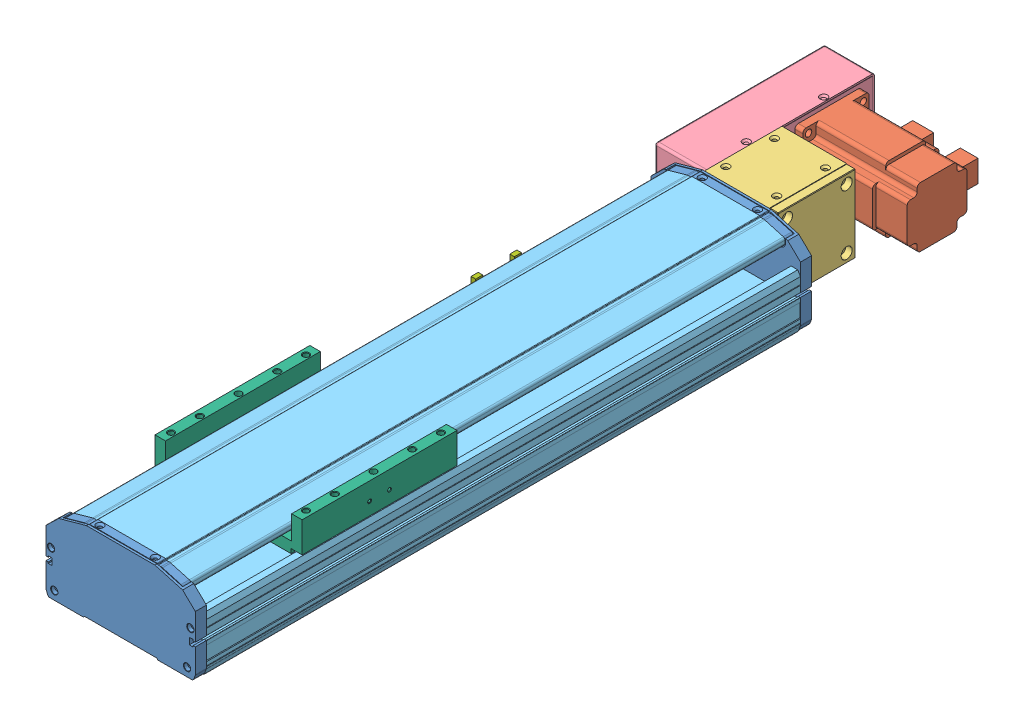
SolidWorks assembly TCD135-T-J4BL-0.SLDASM, configuration 250 (file format 9000). Lengths in mm.
Overall size (150.05 78 715.8).
10 component instances, 7 part files, 28 mates.
Components (placement in the parent):
- TCD135-T-J4BL-5-1: TCD135-T-J4BL-5.SLDPRT [默认] at origin
- TCD135-T-J4BL-3-1: TCD135-T-J4BL-3.SLDPRT [默认] at (-22.25 36.65 -111.8) x (0 0 1) z (1 0 0)
- TCD135-T-J4BL-4-1: TCD135-T-J4BL-4.SLDPRT [默认] at (-29.25 36.9 -35) x (0 -1 0) z (1 0 0)
- TCD135-T-J4BL-6-1: TCD135-T-J4BL-6.SLDPRT [默认] at (-29.25 36.65 -76.75) x (0 0 1) z (-1 0 0)
- TCD135-T-J4BL-5-2: TCD135-T-J4BL-5.SLDPRT [默认] at (0 0 557) x (-1 0 0) z (0 0 -1)
- TCD135-T-J4BL-2-2: TCD135-T-J4BL-2.SLDPRT [250] at (0 0 10) x (-1 0 0) z (0 0 -1) size (135 73.5 537)
- TCD135-T-J4BL-1-1: TCD135-T-J4BL-1.sldprt [默认] at (0 33.9 389.4905)
- TCD135-T-J4BL-7-1: TCD135-T-J4BL-7.sldprt [默认] at (-11 -5.2004 264.6996) x (-1 0 0) z (0 0 -1)
- TCD135-T-J4BL-7-2: TCD135-T-J4BL-7.sldprt [默认] at (-11 -5.2004 536.2996) x (-1 0 0) z (0 0 -1)
- TCD135-T-J4BL-7-3: TCD135-T-J4BL-7.sldprt [默认] at (-11 -5.2004 299.6996) x (-1 0 0) z (0 0 -1)
Mates (geometry in assembly coordinates):
- 重合1: coincident anti-aligned: plane of TCD135-T-J4BL-3-1 through (-29.25 63.65 -84.8) normal (-1 0 0); plane of TCD135-T-J4BL-6-1 through (-29.25 36.65 -76.75) normal (1 0 0)
- 距离1: distance = 11.7 mm aligned: plane of TCD135-T-J4BL-3-1 through (69.15 21.65 -141.8) normal (0 0 -1); plane of TCD135-T-J4BL-6-1 through (-74.25 1.4 -153.5) normal (0 0 -1)
- 距离2: distance = 5.25 mm aligned: plane of TCD135-T-J4BL-3-1 through (69.15 66.65 -126.8) normal (0 1 0); plane of TCD135-T-J4BL-6-1 through (-74.25 71.9 -153.5) normal (0 1 0)
- 重合2: coincident aligned: plane of TCD135-T-J4BL-4-1 through (29.25 71.9 0) normal (0 0 1); plane of TCD135-T-J4BL-6-1 through (-74.25 1.4 0) normal (0 0 1)
- 重合4: coincident anti-aligned: plane of TCD135-T-J4BL-4-1 through (-29.25 36.9 -35) normal (-1 0 0); plane of TCD135-T-J4BL-6-1 through (-29.25 36.65 -76.75) normal (1 0 0)
- 重合5: coincident aligned: plane of TCD135-T-J4BL-5-1 through (30.5 71.9 -105.7277) normal (0 1 0); plane of TCD135-T-J4BL-4-1 through (29.25 71.9 0) normal (0 1 0)
- 距离5: distance = 30.25 mm aligned: plane of TCD135-T-J4BL-4-1 through (37.25 36.9 -35) normal (1 0 0); plane of TCD135-T-J4BL-5-1 through (67.5 29.8 10) normal (1 0 0)
- 重合6: coincident anti-aligned: plane of TCD135-T-J4BL-5-1 through (64.1333 0.9 0) normal (0 0 -1); plane of TCD135-T-J4BL-4-1 through (29.25 71.9 0) normal (0 0 1)
- 重合17: coincident aligned: plane of TCD135-T-J4BL-4-1 through (29.25 71.9 0) normal (0 1 0); plane of TCD135-T-J4BL-6-1 through (-74.25 71.9 -153.5) normal (0 1 0)
- LimitDistance1: limit distance = 389.4905 mm aligned: plane of TCD135-T-J4BL-4-1 through (29.25 71.9 -70) normal (0 0 -1); plane of TCD135-T-J4BL-1-1 through (0 60.65 319.4905) normal (0 0 -1)
- LimitDistance2: limit distance = 97.5095 mm aligned: plane of TCD135-T-J4BL-1-1 through (0 60.65 459.4905) normal (0 0 1); plane of TCD135-T-J4BL-5-2 through (-64.1333 0.9 557) normal (0 0 1)
- 重合18: coincident anti-aligned: plane of TCD135-T-J4BL-5-1 through (64.1333 0.9 10) normal (0 0 1); plane of TCD135-T-J4BL-2-2 through (67.5 6 10) normal (0 0 -1)
- 重合19: coincident aligned: plane of TCD135-T-J4BL-5-1 through (30.5 71.9 -105.7277) normal (0 1 0); plane of TCD135-T-J4BL-2-2 through (-30.5 71.9 547) normal (0 1 0)
- 重合20: coincident aligned: plane of TCD135-T-J4BL-5-1 through (-67.5 29.8 10) normal (-1 0 0); plane of TCD135-T-J4BL-2-2 through (-67.5 22.5 547) normal (-1 0 0)
- 重合21: coincident aligned: plane of TCD135-T-J4BL-5-2 through (-67.5 29.8 547) normal (-1 0 0); plane of TCD135-T-J4BL-2-2 through (-67.5 30.1 547) normal (-1 0 0)
- 重合22: coincident aligned: plane of TCD135-T-J4BL-5-2 through (-30.5 71.9 662.7277) normal (0 1 0); plane of TCD135-T-J4BL-2-2 through (-30.5 71.9 547) normal (0 1 0)
- 重合23: coincident anti-aligned: plane of TCD135-T-J4BL-5-2 through (-64.1333 0.9 547) normal (0 0 -1); plane of TCD135-T-J4BL-2-2 through (67.5 6 547) normal (0 0 1)
- 距离9: distance = 0.5 mm aligned: plane of TCD135-T-J4BL-1-1 through (-66.5 62.65 389.4905) normal (-1 0 0); plane of TCD135-T-J4BL-2-2 through (-67 10 547) normal (-1 0 0)
- 距离10: distance = 78 mm anti-aligned: plane of TCD135-T-J4BL-1-1 through (-61.75 76.4 389.4905) normal (0 1 0); plane of TCD135-T-J4BL-2-2 through (-34.1 -1.6 547) normal (0 -1 0)
- 重合24: coincident anti-aligned: plane of TCD135-T-J4BL-2-2 through (-67.5 22.5 547) normal (-1 0 0); plane of TCD135-T-J4BL-7-1 through (-67.5 17 108.2) normal (1 0 0)
- 重合25: coincident aligned: plane of TCD135-T-J4BL-2-2 through (-67.2 26.2 547) normal (0 1 0); plane of TCD135-T-J4BL-7-1 through (-67.5 26.2 111.6633) normal (0 1 0)
- 重合26: coincident anti-aligned: plane of TCD135-T-J4BL-2-2 through (-67.5 22.5 547) normal (-1 0 0); plane of TCD135-T-J4BL-7-2 through (-67.5 17 379.8) normal (1 0 0)
- 重合27: coincident aligned: plane of TCD135-T-J4BL-2-2 through (-67.2 26.2 547) normal (0 1 0); plane of TCD135-T-J4BL-7-2 through (-67.5 26.2 383.2633) normal (0 1 0)
- 重合28: coincident anti-aligned: plane of TCD135-T-J4BL-2-2 through (-67.5 22.5 547) normal (-1 0 0); plane of TCD135-T-J4BL-7-3 through (-67.5 17 143.2) normal (1 0 0)
- 重合29: coincident aligned: plane of TCD135-T-J4BL-2-2 through (-67.2 26.2 547) normal (0 1 0); plane of TCD135-T-J4BL-7-3 through (-67.5 26.2 146.6633) normal (0 1 0)
- 距离11: distance = 35 mm aligned: plane of TCD135-T-J4BL-7-3 through (-67.5 17 153) normal (0 0 -1); plane of TCD135-T-J4BL-7-1 through (-67.5 17 118) normal (0 0 -1)
- 距离12: distance = 118 mm aligned: plane of TCD135-T-J4BL-5-1 through (64.1333 0.9 0) normal (0 0 -1); plane of TCD135-T-J4BL-7-1 through (-67.5 17 118) normal (0 0 -1)
- 距离13: distance = 161 mm aligned: plane of TCD135-T-J4BL-5-2 through (-64.1333 0.9 557) normal (0 0 1); plane of TCD135-T-J4BL-7-2 through (-67.5 17 396) normal (0 0 1)
